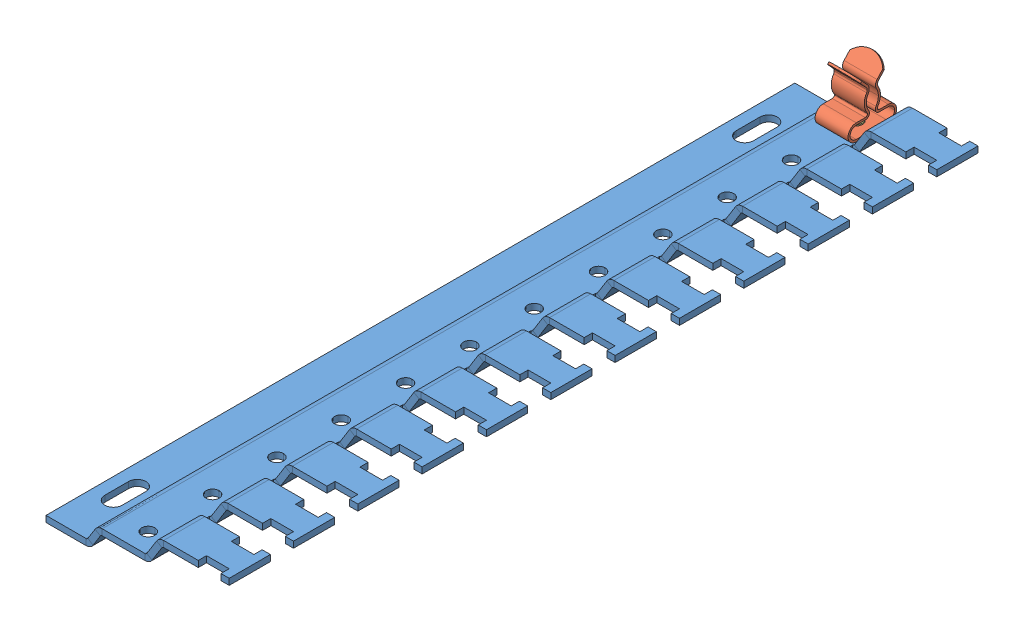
SolidWorks assembly 38050.SLDASM, configuration Default (file format 8000). Lengths in mm.
Overall size (44.42 19.07 182.5).
3 component instances, 3 part files, 0 mates.
Components (placement in the parent):
- 38050_01-1: 38050_01.SLDPRT [Default] at origin size (44.42 10.5 181.6)
- 38050_02-1: 38050_02.SLDPRT [Default] at origin size (8 13.57 11.8)
- 38050_03-1: 38050_03.SLDPRT [Default] at origin size (6 3.3 6)
